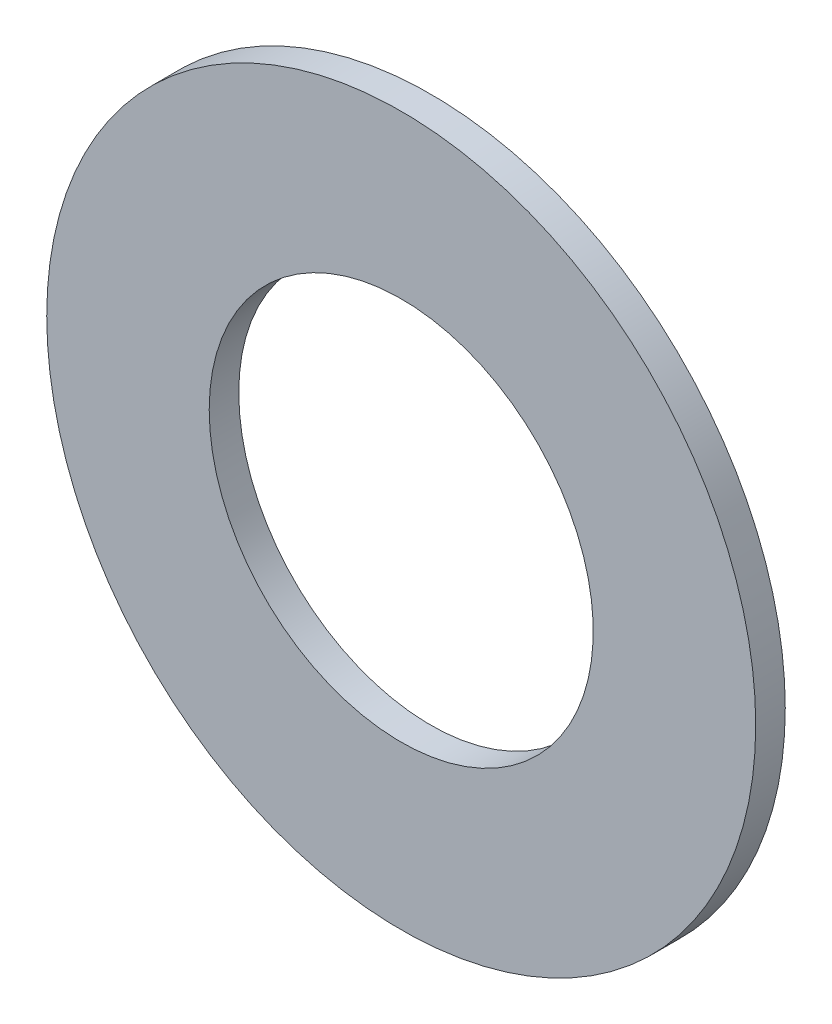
ISO-10303-21;
HEADER;
FILE_DESCRIPTION(('STEP AP214'),'2;1');
FILE_NAME('part.step','',(''),(''),'','','');
FILE_SCHEMA(('AUTOMOTIVE_DESIGN { 1 0 10303 214 1 1 1 1 }'));
ENDSEC;
DATA;
#1=APPLICATION_CONTEXT('core data for automotive mechanical design processes');
#2=APPLICATION_PROTOCOL_DEFINITION('international standard','automotive_design',2000,#1);
#3=PRODUCT_CONTEXT('',#1,'mechanical');
#4=PRODUCT('Part','Part','',(#3));
#5=PRODUCT_RELATED_PRODUCT_CATEGORY('part','',(#4));
#6=PRODUCT_DEFINITION_FORMATION('','',#4);
#7=PRODUCT_DEFINITION_CONTEXT('part definition',#1,'design');
#8=PRODUCT_DEFINITION('design','',#6,#7);
#9=PRODUCT_DEFINITION_SHAPE('','',#8);
#10=(LENGTH_UNIT() NAMED_UNIT(*) SI_UNIT(.MILLI.,.METRE.));
#11=(NAMED_UNIT(*) PLANE_ANGLE_UNIT() SI_UNIT($,.RADIAN.));
#12=(NAMED_UNIT(*) SI_UNIT($,.STERADIAN.) SOLID_ANGLE_UNIT());
#13=UNCERTAINTY_MEASURE_WITH_UNIT(LENGTH_MEASURE(1.E-05),#10,'distance_accuracy_value','');
#14=(GEOMETRIC_REPRESENTATION_CONTEXT(3) GLOBAL_UNCERTAINTY_ASSIGNED_CONTEXT((#13)) GLOBAL_UNIT_ASSIGNED_CONTEXT((#10,
#11,#12)) REPRESENTATION_CONTEXT('',''));
#15=CARTESIAN_POINT('',(0.,0.,0.));
#16=DIRECTION('',(0.,0.,1.));
#17=DIRECTION('',(1.,0.,0.));
#18=AXIS2_PLACEMENT_3D('',#15,#16,#17);
#19=CARTESIAN_POINT('',(0.,0.,0.5));
#20=DIRECTION('',(0.,0.,0.999999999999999));
#21=DIRECTION('',(1.,0.,0.));
#22=AXIS2_PLACEMENT_3D('',#19,#20,#21);
#23=PLANE('',#22);
#24=CARTESIAN_POINT('',(0.,0.,0.5));
#25=DIRECTION('',(0.,0.,0.999999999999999));
#26=DIRECTION('',(1.,0.,0.));
#27=AXIS2_PLACEMENT_3D('',#24,#25,#26);
#28=CIRCLE('',#27,6.);
#29=CARTESIAN_POINT('',(-6.00000000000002,0.,0.499999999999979));
#30=VERTEX_POINT('',#29);
#31=EDGE_CURVE('E10',#30,#30,#28,.T.);
#32=ORIENTED_EDGE('',*,*,#31,.T.);
#33=EDGE_LOOP('',(#32));
#34=FACE_BOUND('',#33,.T.);
#35=CARTESIAN_POINT('',(0.,0.,0.5));
#36=DIRECTION('',(0.,0.,0.999999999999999));
#37=DIRECTION('',(1.,0.,0.));
#38=AXIS2_PLACEMENT_3D('',#35,#36,#37);
#39=CIRCLE('',#38,3.25);
#40=CARTESIAN_POINT('',(-3.25000000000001,0.,0.499999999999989));
#41=VERTEX_POINT('',#40);
#42=EDGE_CURVE('E39',#41,#41,#39,.T.);
#43=ORIENTED_EDGE('',*,*,#42,.F.);
#44=EDGE_LOOP('',(#43));
#45=FACE_BOUND('',#44,.T.);
#46=ADVANCED_FACE('F28',(#34,#45),#23,.T.);
#47=CARTESIAN_POINT('',(0.,0.,0.));
#48=DIRECTION('',(0.,0.,0.999999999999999));
#49=DIRECTION('',(1.,0.,0.));
#50=AXIS2_PLACEMENT_3D('',#47,#48,#49);
#51=PLANE('',#50);
#52=CARTESIAN_POINT('',(0.,0.,0.));
#53=DIRECTION('',(0.,0.,0.999999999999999));
#54=DIRECTION('',(1.,0.,0.));
#55=AXIS2_PLACEMENT_3D('',#52,#53,#54);
#56=CIRCLE('',#55,6.);
#57=CARTESIAN_POINT('',(-6.00000000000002,0.,0.));
#58=VERTEX_POINT('',#57);
#59=EDGE_CURVE('E35',#58,#58,#56,.T.);
#60=ORIENTED_EDGE('',*,*,#59,.F.);
#61=EDGE_LOOP('',(#60));
#62=FACE_BOUND('',#61,.T.);
#63=CARTESIAN_POINT('',(0.,0.,0.));
#64=DIRECTION('',(0.,0.,0.999999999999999));
#65=DIRECTION('',(1.,0.,0.));
#66=AXIS2_PLACEMENT_3D('',#63,#64,#65);
#67=CIRCLE('',#66,3.25);
#68=CARTESIAN_POINT('',(-3.25000000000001,0.,0.));
#69=VERTEX_POINT('',#68);
#70=EDGE_CURVE('E43',#69,#69,#67,.T.);
#71=ORIENTED_EDGE('',*,*,#70,.T.);
#72=EDGE_LOOP('',(#71));
#73=FACE_BOUND('',#72,.T.);
#74=ADVANCED_FACE('F49',(#62,#73),#51,.F.);
#75=CARTESIAN_POINT('',(0.,0.,0.5));
#76=DIRECTION('',(0.,0.,-0.999999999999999));
#77=DIRECTION('',(-1.,0.,0.));
#78=AXIS2_PLACEMENT_3D('',#75,#76,#77);
#79=CYLINDRICAL_SURFACE('',#78,6.);
#80=CARTESIAN_POINT('',(-6.00000000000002,0.,0.499999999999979));
#81=CARTESIAN_POINT('',(-6.00000000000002,0.,0.494791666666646));
#82=CARTESIAN_POINT('',(-6.00000000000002,0.,0.489583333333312));
#83=CARTESIAN_POINT('',(-6.00000000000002,0.,0.479166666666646));
#84=CARTESIAN_POINT('',(-6.00000000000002,0.,0.473958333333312));
#85=CARTESIAN_POINT('',(-6.00000000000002,0.,0.463541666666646));
#86=CARTESIAN_POINT('',(-6.00000000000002,0.,0.458333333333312));
#87=CARTESIAN_POINT('',(-6.00000000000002,0.,0.447916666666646));
#88=CARTESIAN_POINT('',(-6.00000000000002,0.,0.442708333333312));
#89=CARTESIAN_POINT('',(-6.00000000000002,0.,0.432291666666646));
#90=CARTESIAN_POINT('',(-6.00000000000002,0.,0.427083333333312));
#91=CARTESIAN_POINT('',(-6.00000000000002,0.,0.416666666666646));
#92=CARTESIAN_POINT('',(-6.00000000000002,0.,0.411458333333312));
#93=CARTESIAN_POINT('',(-6.00000000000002,0.,0.401041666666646));
#94=CARTESIAN_POINT('',(-6.00000000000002,0.,0.395833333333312));
#95=CARTESIAN_POINT('',(-6.00000000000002,0.,0.385416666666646));
#96=CARTESIAN_POINT('',(-6.00000000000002,0.,0.380208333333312));
#97=CARTESIAN_POINT('',(-6.00000000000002,0.,0.369791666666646));
#98=CARTESIAN_POINT('',(-6.00000000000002,0.,0.364583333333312));
#99=CARTESIAN_POINT('',(-6.00000000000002,0.,0.354166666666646));
#100=CARTESIAN_POINT('',(-6.00000000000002,0.,0.348958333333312));
#101=CARTESIAN_POINT('',(-6.00000000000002,0.,0.338541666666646));
#102=CARTESIAN_POINT('',(-6.00000000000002,0.,0.333333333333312));
#103=CARTESIAN_POINT('',(-6.00000000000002,0.,0.322916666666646));
#104=CARTESIAN_POINT('',(-6.00000000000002,0.,0.317708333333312));
#105=CARTESIAN_POINT('',(-6.00000000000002,0.,0.307291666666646));
#106=CARTESIAN_POINT('',(-6.00000000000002,0.,0.302083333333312));
#107=CARTESIAN_POINT('',(-6.00000000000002,0.,0.291666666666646));
#108=CARTESIAN_POINT('',(-6.00000000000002,0.,0.286458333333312));
#109=CARTESIAN_POINT('',(-6.00000000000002,0.,0.276041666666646));
#110=CARTESIAN_POINT('',(-6.00000000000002,0.,0.270833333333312));
#111=CARTESIAN_POINT('',(-6.00000000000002,0.,0.260416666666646));
#112=CARTESIAN_POINT('',(-6.00000000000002,0.,0.255208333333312));
#113=CARTESIAN_POINT('',(-6.00000000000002,0.,0.244791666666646));
#114=CARTESIAN_POINT('',(-6.00000000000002,0.,0.239583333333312));
#115=CARTESIAN_POINT('',(-6.00000000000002,0.,0.229166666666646));
#116=CARTESIAN_POINT('',(-6.00000000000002,0.,0.223958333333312));
#117=CARTESIAN_POINT('',(-6.00000000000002,0.,0.213541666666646));
#118=CARTESIAN_POINT('',(-6.00000000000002,0.,0.208333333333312));
#119=CARTESIAN_POINT('',(-6.00000000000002,0.,0.197916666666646));
#120=CARTESIAN_POINT('',(-6.00000000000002,0.,0.192708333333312));
#121=CARTESIAN_POINT('',(-6.00000000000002,0.,0.182291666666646));
#122=CARTESIAN_POINT('',(-6.00000000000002,0.,0.177083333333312));
#123=CARTESIAN_POINT('',(-6.00000000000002,0.,0.166666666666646));
#124=CARTESIAN_POINT('',(-6.00000000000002,0.,0.161458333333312));
#125=CARTESIAN_POINT('',(-6.00000000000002,0.,0.151041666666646));
#126=CARTESIAN_POINT('',(-6.00000000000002,0.,0.145833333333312));
#127=CARTESIAN_POINT('',(-6.00000000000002,0.,0.135416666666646));
#128=CARTESIAN_POINT('',(-6.00000000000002,0.,0.130208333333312));
#129=CARTESIAN_POINT('',(-6.00000000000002,0.,0.119791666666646));
#130=CARTESIAN_POINT('',(-6.00000000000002,0.,0.114583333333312));
#131=CARTESIAN_POINT('',(-6.00000000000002,0.,0.104166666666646));
#132=CARTESIAN_POINT('',(-6.00000000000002,0.,0.0989583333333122));
#133=CARTESIAN_POINT('',(-6.00000000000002,0.,0.0885416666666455));
#134=CARTESIAN_POINT('',(-6.00000000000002,0.,0.0833333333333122));
#135=CARTESIAN_POINT('',(-6.00000000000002,0.,0.0729166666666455));
#136=CARTESIAN_POINT('',(-6.00000000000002,0.,0.0677083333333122));
#137=CARTESIAN_POINT('',(-6.00000000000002,0.,0.0572916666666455));
#138=CARTESIAN_POINT('',(-6.00000000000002,0.,0.0520833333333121));
#139=CARTESIAN_POINT('',(-6.00000000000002,0.,0.0416666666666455));
#140=CARTESIAN_POINT('',(-6.00000000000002,0.,0.0364583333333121));
#141=CARTESIAN_POINT('',(-6.00000000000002,0.,0.0260416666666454));
#142=CARTESIAN_POINT('',(-6.00000000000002,0.,0.0208333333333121));
#143=CARTESIAN_POINT('',(-6.00000000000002,0.,0.0104166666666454));
#144=CARTESIAN_POINT('',(-6.00000000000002,0.,0.00520833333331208));
#145=CARTESIAN_POINT('',(-6.00000000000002,0.,0.));
#146=B_SPLINE_CURVE_WITH_KNOTS('',3,(#80,#81,#82,#83,#84,#85,#86,#87,#88,#89,#90,#91,#92,#93,
#94,#95,#96,#97,#98,#99,#100,#101,#102,#103,#104,#105,#106,#107,#108,#109,#110,#111,#112,#113,
#114,#115,#116,#117,#118,#119,#120,#121,#122,#123,#124,#125,#126,#127,#128,#129,#130,#131,#132,
#133,#134,#135,#136,#137,#138,#139,#140,#141,#142,#143,#144,#145),.UNSPECIFIED.,.F.,.F.,(4,2,2,
2,2,2,2,2,2,2,2,2,2,2,2,2,2,2,2,2,2,2,2,2,2,2,2,2,2,2,2,2,4),(0.,0.015625,0.03125,0.046875,
0.0625,0.078125,0.09375,0.109375,0.125,0.140625,0.15625,0.171875,0.1875,0.203125,0.21875,
0.234375,0.25,0.265625,0.28125,0.296875,0.3125,0.328125,0.34375,0.359375,0.375,0.390625,0.40625,
0.421875,0.4375,0.453125,0.46875,0.484375,0.5),.UNSPECIFIED.);
#147=EDGE_CURVE('BSEAM30',#30,#58,#146,.T.);
#148=ORIENTED_EDGE('',*,*,#31,.F.);
#149=ORIENTED_EDGE('',*,*,#59,.T.);
#150=ORIENTED_EDGE('',*,*,#147,.T.);
#151=ORIENTED_EDGE('',*,*,#147,.F.);
#152=EDGE_LOOP('',(#148,#150,#149,#151));
#153=FACE_BOUND('',#152,.T.);
#154=ADVANCED_FACE('F30',(#153),#79,.T.);
#155=CARTESIAN_POINT('',(0.,0.,0.5));
#156=DIRECTION('',(0.,0.,-0.999999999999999));
#157=DIRECTION('',(-1.,0.,0.));
#158=AXIS2_PLACEMENT_3D('',#155,#156,#157);
#159=CYLINDRICAL_SURFACE('',#158,3.25);
#160=CARTESIAN_POINT('',(-3.25000000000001,0.,0.499999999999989));
#161=CARTESIAN_POINT('',(-3.25000000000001,0.,0.494791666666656));
#162=CARTESIAN_POINT('',(-3.25000000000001,0.,0.489583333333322));
#163=CARTESIAN_POINT('',(-3.25000000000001,0.,0.479166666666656));
#164=CARTESIAN_POINT('',(-3.25000000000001,0.,0.473958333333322));
#165=CARTESIAN_POINT('',(-3.25000000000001,0.,0.463541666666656));
#166=CARTESIAN_POINT('',(-3.25000000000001,0.,0.458333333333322));
#167=CARTESIAN_POINT('',(-3.25000000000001,0.,0.447916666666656));
#168=CARTESIAN_POINT('',(-3.25000000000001,0.,0.442708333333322));
#169=CARTESIAN_POINT('',(-3.25000000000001,0.,0.432291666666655));
#170=CARTESIAN_POINT('',(-3.25000000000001,0.,0.427083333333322));
#171=CARTESIAN_POINT('',(-3.25000000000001,0.,0.416666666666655));
#172=CARTESIAN_POINT('',(-3.25000000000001,0.,0.411458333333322));
#173=CARTESIAN_POINT('',(-3.25000000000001,0.,0.401041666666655));
#174=CARTESIAN_POINT('',(-3.25000000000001,0.,0.395833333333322));
#175=CARTESIAN_POINT('',(-3.25000000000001,0.,0.385416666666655));
#176=CARTESIAN_POINT('',(-3.25000000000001,0.,0.380208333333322));
#177=CARTESIAN_POINT('',(-3.25000000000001,0.,0.369791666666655));
#178=CARTESIAN_POINT('',(-3.25000000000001,0.,0.364583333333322));
#179=CARTESIAN_POINT('',(-3.25000000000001,0.,0.354166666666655));
#180=CARTESIAN_POINT('',(-3.25000000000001,0.,0.348958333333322));
#181=CARTESIAN_POINT('',(-3.25000000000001,0.,0.338541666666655));
#182=CARTESIAN_POINT('',(-3.25000000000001,0.,0.333333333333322));
#183=CARTESIAN_POINT('',(-3.25000000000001,0.,0.322916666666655));
#184=CARTESIAN_POINT('',(-3.25000000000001,0.,0.317708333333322));
#185=CARTESIAN_POINT('',(-3.25000000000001,0.,0.307291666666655));
#186=CARTESIAN_POINT('',(-3.25000000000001,0.,0.302083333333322));
#187=CARTESIAN_POINT('',(-3.25000000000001,0.,0.291666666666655));
#188=CARTESIAN_POINT('',(-3.25000000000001,0.,0.286458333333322));
#189=CARTESIAN_POINT('',(-3.25000000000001,0.,0.276041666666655));
#190=CARTESIAN_POINT('',(-3.25000000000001,0.,0.270833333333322));
#191=CARTESIAN_POINT('',(-3.25000000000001,0.,0.260416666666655));
#192=CARTESIAN_POINT('',(-3.25000000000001,0.,0.255208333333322));
#193=CARTESIAN_POINT('',(-3.25000000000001,0.,0.244791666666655));
#194=CARTESIAN_POINT('',(-3.25000000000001,0.,0.239583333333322));
#195=CARTESIAN_POINT('',(-3.25000000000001,0.,0.229166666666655));
#196=CARTESIAN_POINT('',(-3.25000000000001,0.,0.223958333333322));
#197=CARTESIAN_POINT('',(-3.25000000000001,0.,0.213541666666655));
#198=CARTESIAN_POINT('',(-3.25000000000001,0.,0.208333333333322));
#199=CARTESIAN_POINT('',(-3.25000000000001,0.,0.197916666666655));
#200=CARTESIAN_POINT('',(-3.25000000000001,0.,0.192708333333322));
#201=CARTESIAN_POINT('',(-3.25000000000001,0.,0.182291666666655));
#202=CARTESIAN_POINT('',(-3.25000000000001,0.,0.177083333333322));
#203=CARTESIAN_POINT('',(-3.25000000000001,0.,0.166666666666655));
#204=CARTESIAN_POINT('',(-3.25000000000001,0.,0.161458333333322));
#205=CARTESIAN_POINT('',(-3.25000000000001,0.,0.151041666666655));
#206=CARTESIAN_POINT('',(-3.25000000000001,0.,0.145833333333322));
#207=CARTESIAN_POINT('',(-3.25000000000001,0.,0.135416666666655));
#208=CARTESIAN_POINT('',(-3.25000000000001,0.,0.130208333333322));
#209=CARTESIAN_POINT('',(-3.25000000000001,0.,0.119791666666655));
#210=CARTESIAN_POINT('',(-3.25000000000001,0.,0.114583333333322));
#211=CARTESIAN_POINT('',(-3.25000000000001,0.,0.104166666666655));
#212=CARTESIAN_POINT('',(-3.25000000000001,0.,0.0989583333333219));
#213=CARTESIAN_POINT('',(-3.25000000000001,0.,0.0885416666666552));
#214=CARTESIAN_POINT('',(-3.25000000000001,0.,0.0833333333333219));
#215=CARTESIAN_POINT('',(-3.25000000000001,0.,0.0729166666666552));
#216=CARTESIAN_POINT('',(-3.25000000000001,0.,0.0677083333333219));
#217=CARTESIAN_POINT('',(-3.25000000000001,0.,0.0572916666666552));
#218=CARTESIAN_POINT('',(-3.25000000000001,0.,0.0520833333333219));
#219=CARTESIAN_POINT('',(-3.25000000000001,0.,0.0416666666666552));
#220=CARTESIAN_POINT('',(-3.25000000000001,0.,0.0364583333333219));
#221=CARTESIAN_POINT('',(-3.25000000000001,0.,0.0260416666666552));
#222=CARTESIAN_POINT('',(-3.25000000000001,0.,0.0208333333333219));
#223=CARTESIAN_POINT('',(-3.25000000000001,0.,0.0104166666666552));
#224=CARTESIAN_POINT('',(-3.25000000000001,0.,0.00520833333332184));
#225=CARTESIAN_POINT('',(-3.25000000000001,0.,0.));
#226=B_SPLINE_CURVE_WITH_KNOTS('',3,(#160,#161,#162,#163,#164,#165,#166,#167,#168,#169,#170,
#171,#172,#173,#174,#175,#176,#177,#178,#179,#180,#181,#182,#183,#184,#185,#186,#187,#188,#189,
#190,#191,#192,#193,#194,#195,#196,#197,#198,#199,#200,#201,#202,#203,#204,#205,#206,#207,#208,
#209,#210,#211,#212,#213,#214,#215,#216,#217,#218,#219,#220,#221,#222,#223,#224,#225),
.UNSPECIFIED.,.F.,.F.,(4,2,2,2,2,2,2,2,2,2,2,2,2,2,2,2,2,2,2,2,2,2,2,2,2,2,2,2,2,2,2,2,4),(0.,
0.015625,0.03125,0.046875,0.0625,0.078125,0.09375,0.109375,0.125,0.140625,0.15625,0.171875,
0.1875,0.203125,0.21875,0.234375,0.25,0.265625,0.28125,0.296875,0.3125,0.328125,0.34375,
0.359375,0.375,0.390625,0.40625,0.421875,0.4375,0.453125,0.46875,0.484375,0.5),.UNSPECIFIED.);
#227=EDGE_CURVE('BSEAM51',#41,#69,#226,.T.);
#228=ORIENTED_EDGE('',*,*,#42,.T.);
#229=ORIENTED_EDGE('',*,*,#70,.F.);
#230=ORIENTED_EDGE('',*,*,#227,.T.);
#231=ORIENTED_EDGE('',*,*,#227,.F.);
#232=EDGE_LOOP('',(#228,#230,#229,#231));
#233=FACE_BOUND('',#232,.T.);
#234=ADVANCED_FACE('F51',(#233),#159,.F.);
#235=CLOSED_SHELL('',(#46,#74,#154,#234));
#236=MANIFOLD_SOLID_BREP('B2',#235);
#237=ADVANCED_BREP_SHAPE_REPRESENTATION('',(#18,#236),#14);
#238=SHAPE_DEFINITION_REPRESENTATION(#9,#237);
ENDSEC;
END-ISO-10303-21;
